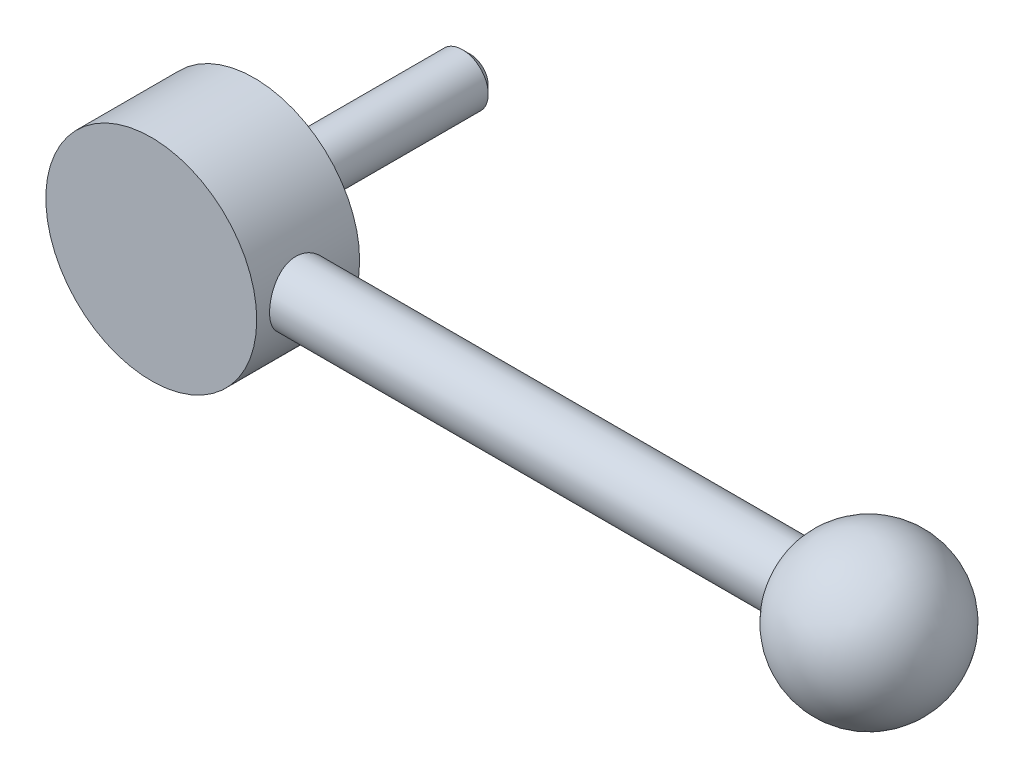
ISO-10303-21;
HEADER;
FILE_DESCRIPTION(('STEP AP214'),'2;1');
FILE_NAME('part.step','',(''),(''),'','','');
FILE_SCHEMA(('AUTOMOTIVE_DESIGN { 1 0 10303 214 1 1 1 1 }'));
ENDSEC;
DATA;
#1=APPLICATION_CONTEXT('core data for automotive mechanical design processes');
#2=APPLICATION_PROTOCOL_DEFINITION('international standard','automotive_design',2000,#1);
#3=PRODUCT_CONTEXT('',#1,'mechanical');
#4=PRODUCT('Part','Part','',(#3));
#5=PRODUCT_RELATED_PRODUCT_CATEGORY('part','',(#4));
#6=PRODUCT_DEFINITION_FORMATION('','',#4);
#7=PRODUCT_DEFINITION_CONTEXT('part definition',#1,'design');
#8=PRODUCT_DEFINITION('design','',#6,#7);
#9=PRODUCT_DEFINITION_SHAPE('','',#8);
#10=(LENGTH_UNIT() NAMED_UNIT(*) SI_UNIT(.MILLI.,.METRE.));
#11=(NAMED_UNIT(*) PLANE_ANGLE_UNIT() SI_UNIT($,.RADIAN.));
#12=(NAMED_UNIT(*) SI_UNIT($,.STERADIAN.) SOLID_ANGLE_UNIT());
#13=UNCERTAINTY_MEASURE_WITH_UNIT(LENGTH_MEASURE(1.E-05),#10,'distance_accuracy_value','');
#14=(GEOMETRIC_REPRESENTATION_CONTEXT(3) GLOBAL_UNCERTAINTY_ASSIGNED_CONTEXT((#13)) GLOBAL_UNIT_ASSIGNED_CONTEXT((#10,
#11,#12)) REPRESENTATION_CONTEXT('',''));
#15=CARTESIAN_POINT('',(0.,0.,0.));
#16=DIRECTION('',(0.,0.,1.));
#17=DIRECTION('',(1.,0.,0.));
#18=AXIS2_PLACEMENT_3D('',#15,#16,#17);
#19=CARTESIAN_POINT('',(0.,0.,40.));
#20=DIRECTION('',(0.,0.,1.));
#21=DIRECTION('',(1.,0.,0.));
#22=AXIS2_PLACEMENT_3D('',#19,#20,#21);
#23=CYLINDRICAL_SURFACE('',#22,9.5);
#24=CARTESIAN_POINT('',(0.,0.,2.));
#25=DIRECTION('',(0.,0.,1.));
#26=DIRECTION('',(1.,0.,0.));
#27=AXIS2_PLACEMENT_3D('',#24,#25,#26);
#28=CIRCLE('',#27,9.5);
#29=CARTESIAN_POINT('',(9.5,0.,2.));
#30=VERTEX_POINT('',#29);
#31=EDGE_CURVE('E37',#30,#30,#28,.T.);
#32=ORIENTED_EDGE('',*,*,#31,.F.);
#33=EDGE_LOOP('',(#32));
#34=FACE_BOUND('',#33,.T.);
#35=CARTESIAN_POINT('',(0.,0.,0.));
#36=DIRECTION('',(0.,0.,1.));
#37=DIRECTION('',(1.,0.,0.));
#38=AXIS2_PLACEMENT_3D('',#35,#36,#37);
#39=CIRCLE('',#38,9.5);
#40=CARTESIAN_POINT('',(9.5,0.,0.));
#41=VERTEX_POINT('',#40);
#42=EDGE_CURVE('E23',#41,#41,#39,.T.);
#43=ORIENTED_EDGE('',*,*,#42,.T.);
#44=EDGE_LOOP('',(#43));
#45=FACE_BOUND('',#44,.T.);
#46=ADVANCED_FACE('F12',(#34,#45),#23,.T.);
#47=CARTESIAN_POINT('',(5.,0.,0.));
#48=DIRECTION('',(0.,0.,1.));
#49=DIRECTION('',(1.,0.,0.));
#50=AXIS2_PLACEMENT_3D('',#47,#48,#49);
#51=PLANE('',#50);
#52=ORIENTED_EDGE('',*,*,#42,.F.);
#53=EDGE_LOOP('',(#52));
#54=FACE_BOUND('',#53,.T.);
#55=CARTESIAN_POINT('',(0.,0.,0.));
#56=DIRECTION('',(0.,0.,1.));
#57=DIRECTION('',(1.,0.,0.));
#58=AXIS2_PLACEMENT_3D('',#55,#56,#57);
#59=CIRCLE('',#58,5.);
#60=CARTESIAN_POINT('',(5.,0.,0.));
#61=VERTEX_POINT('',#60);
#62=EDGE_CURVE('E27',#61,#61,#59,.T.);
#63=ORIENTED_EDGE('',*,*,#62,.T.);
#64=EDGE_LOOP('',(#63));
#65=FACE_BOUND('',#64,.T.);
#66=ADVANCED_FACE('F63',(#54,#65),#51,.F.);
#67=CARTESIAN_POINT('',(0.,0.,40.));
#68=DIRECTION('',(0.,0.,1.));
#69=DIRECTION('',(1.,0.,0.));
#70=AXIS2_PLACEMENT_3D('',#67,#68,#69);
#71=CYLINDRICAL_SURFACE('',#70,5.);
#72=CARTESIAN_POINT('',(0.,0.,-38.5));
#73=DIRECTION('',(0.,0.,-1.));
#74=DIRECTION('',(-1.,0.,0.));
#75=AXIS2_PLACEMENT_3D('',#72,#73,#74);
#76=CIRCLE('',#75,5.);
#77=CARTESIAN_POINT('',(-5.,0.,-38.5));
#78=VERTEX_POINT('',#77);
#79=EDGE_CURVE('E19',#78,#78,#76,.F.);
#80=ORIENTED_EDGE('',*,*,#79,.T.);
#81=EDGE_LOOP('',(#80));
#82=FACE_BOUND('',#81,.T.);
#83=ORIENTED_EDGE('',*,*,#62,.F.);
#84=EDGE_LOOP('',(#83));
#85=FACE_BOUND('',#84,.T.);
#86=ADVANCED_FACE('F69',(#82,#85),#71,.T.);
#87=CARTESIAN_POINT('',(5.,0.,-40.));
#88=DIRECTION('',(0.,0.,-1.));
#89=DIRECTION('',(-1.,0.,0.));
#90=AXIS2_PLACEMENT_3D('',#87,#88,#89);
#91=PLANE('',#90);
#92=CARTESIAN_POINT('',(0.,0.,-40.));
#93=DIRECTION('',(0.,0.,-1.));
#94=DIRECTION('',(-1.,0.,0.));
#95=AXIS2_PLACEMENT_3D('',#92,#93,#94);
#96=CIRCLE('',#95,3.5);
#97=CARTESIAN_POINT('',(-3.5,0.,-40.));
#98=VERTEX_POINT('',#97);
#99=EDGE_CURVE('E8',#98,#98,#96,.T.);
#100=ORIENTED_EDGE('',*,*,#99,.T.);
#101=EDGE_LOOP('',(#100));
#102=FACE_BOUND('',#101,.T.);
#103=ADVANCED_FACE('F77',(#102),#91,.T.);
#104=CARTESIAN_POINT('',(20.5,0.,22.));
#105=DIRECTION('',(0.,0.,-1.));
#106=DIRECTION('',(-1.,0.,0.));
#107=AXIS2_PLACEMENT_3D('',#104,#105,#106);
#108=PLANE('',#107);
#109=CARTESIAN_POINT('',(0.,0.,22.));
#110=DIRECTION('',(0.,0.,1.));
#111=DIRECTION('',(1.,0.,0.));
#112=AXIS2_PLACEMENT_3D('',#109,#110,#111);
#113=CIRCLE('',#112,20.5);
#114=CARTESIAN_POINT('',(20.5,0.,22.));
#115=VERTEX_POINT('',#114);
#116=EDGE_CURVE('E86',#115,#115,#113,.T.);
#117=ORIENTED_EDGE('',*,*,#116,.T.);
#118=EDGE_LOOP('',(#117));
#119=FACE_BOUND('',#118,.T.);
#120=ADVANCED_FACE('F58',(#119),#108,.F.);
#121=CARTESIAN_POINT('',(0.,0.,40.));
#122=DIRECTION('',(0.,0.,1.));
#123=DIRECTION('',(1.,0.,0.));
#124=AXIS2_PLACEMENT_3D('',#121,#122,#123);
#125=CYLINDRICAL_SURFACE('',#124,20.5);
#126=CARTESIAN_POINT('',(20.5,0.,7.5));
#127=CARTESIAN_POINT('',(20.4999997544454,-0.164768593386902,7.50000038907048));
#128=CARTESIAN_POINT('',(20.4980087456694,-0.329544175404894,7.50679278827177));
#129=CARTESIAN_POINT('',(20.4900990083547,-0.65788822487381,7.5339021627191));
#130=CARTESIAN_POINT('',(20.4841800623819,-0.821456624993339,7.55421988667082));
#131=CARTESIAN_POINT('',(20.4685766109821,-1.1462122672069,7.60820100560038));
#132=CARTESIAN_POINT('',(20.4588916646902,-1.30739922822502,7.64186596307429));
#133=CARTESIAN_POINT('',(20.4360164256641,-1.62628314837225,7.72226244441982));
#134=CARTESIAN_POINT('',(20.4228249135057,-1.7839788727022,7.76899851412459));
#135=CARTESIAN_POINT('',(20.3933182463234,-2.09448185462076,7.87505403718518));
#136=CARTESIAN_POINT('',(20.3770082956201,-2.24729676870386,7.93435254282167));
#137=CARTESIAN_POINT('',(20.3416823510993,-2.54730770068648,8.06511256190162));
#138=CARTESIAN_POINT('',(20.3226662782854,-2.69450355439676,8.13657443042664));
#139=CARTESIAN_POINT('',(20.2824208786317,-2.98237032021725,8.2911456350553));
#140=CARTESIAN_POINT('',(20.2611910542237,-3.123039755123,8.37425759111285));
#141=CARTESIAN_POINT('',(20.2170775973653,-3.39691169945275,8.55150630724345));
#142=CARTESIAN_POINT('',(20.1941944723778,-3.53011647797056,8.6456396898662));
#143=CARTESIAN_POINT('',(20.146767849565,-3.79154794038,8.84682399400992));
#144=CARTESIAN_POINT('',(20.1221971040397,-3.91956600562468,8.95413966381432));
#145=CARTESIAN_POINT('',(20.0725990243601,-4.1661228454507,9.17897611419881));
#146=CARTESIAN_POINT('',(20.0475718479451,-4.2846648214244,9.29649342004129));
#147=CARTESIAN_POINT('',(19.9977175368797,-4.5116297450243,9.54108035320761));
#148=CARTESIAN_POINT('',(19.9728905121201,-4.62004743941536,9.66815487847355));
#149=CARTESIAN_POINT('',(19.9241410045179,-4.82595045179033,9.93095842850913));
#150=CARTESIAN_POINT('',(19.9002181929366,-4.92343976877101,10.0666842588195));
#151=CARTESIAN_POINT('',(19.8534354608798,-5.10885934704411,10.3490171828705));
#152=CARTESIAN_POINT('',(19.8306098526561,-5.19653638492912,10.4957964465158));
#153=CARTESIAN_POINT('',(19.7872868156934,-5.35913808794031,10.7965125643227));
#154=CARTESIAN_POINT('',(19.766788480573,-5.43406772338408,10.9504465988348));
#155=CARTESIAN_POINT('',(19.7287391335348,-5.57062666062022,11.2645036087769));
#156=CARTESIAN_POINT('',(19.7111887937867,-5.63225293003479,11.4246279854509));
#157=CARTESIAN_POINT('',(19.6796082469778,-5.74162541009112,11.7498143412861));
#158=CARTESIAN_POINT('',(19.6655765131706,-5.78937764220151,11.9148741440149));
#159=CARTESIAN_POINT('',(19.6418018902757,-5.86952471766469,12.2443484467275));
#160=CARTESIAN_POINT('',(19.6319555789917,-5.90229162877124,12.4086649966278));
#161=CARTESIAN_POINT('',(19.6163432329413,-5.95397424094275,12.7395899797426));
#162=CARTESIAN_POINT('',(19.6105755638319,-5.97289549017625,12.9061974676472));
#163=CARTESIAN_POINT('',(19.603301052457,-5.99672775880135,13.2405034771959));
#164=CARTESIAN_POINT('',(19.6017941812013,-6.00163887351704,13.4082019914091));
#165=CARTESIAN_POINT('',(19.6030905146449,-5.99740342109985,13.7434027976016));
#166=CARTESIAN_POINT('',(19.6058936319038,-5.98825713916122,13.9109050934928));
#167=CARTESIAN_POINT('',(19.6155486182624,-5.95655212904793,14.238688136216));
#168=CARTESIAN_POINT('',(19.6222578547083,-5.9344657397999,14.3990190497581));
#169=CARTESIAN_POINT('',(19.6394095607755,-5.87745500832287,14.7172343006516));
#170=CARTESIAN_POINT('',(19.649853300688,-5.84252629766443,14.8751177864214));
#171=CARTESIAN_POINT('',(19.6741615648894,-5.7601395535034,15.187257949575));
#172=CARTESIAN_POINT('',(19.688025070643,-5.71268525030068,15.3415156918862));
#173=CARTESIAN_POINT('',(19.7187796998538,-5.60560692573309,15.6454959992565));
#174=CARTESIAN_POINT('',(19.7356719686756,-5.5459782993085,15.7952168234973));
#175=CARTESIAN_POINT('',(19.7722410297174,-5.41416819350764,16.0910079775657));
#176=CARTESIAN_POINT('',(19.7919506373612,-5.34183608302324,16.2370072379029));
#177=CARTESIAN_POINT('',(19.8334359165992,-5.18568691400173,16.5224423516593));
#178=CARTESIAN_POINT('',(19.8552123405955,-5.10186566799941,16.6618757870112));
#179=CARTESIAN_POINT('',(19.9227548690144,-4.8340177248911,17.0689782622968));
#180=CARTESIAN_POINT('',(19.9707648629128,-4.63350124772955,17.3256854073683));
#181=CARTESIAN_POINT('',(20.0696162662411,-4.18511260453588,17.8126329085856));
#182=CARTESIAN_POINT('',(20.1204944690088,-3.93567819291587,18.0414205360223));
#183=CARTESIAN_POINT('',(20.2176813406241,-3.40132203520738,18.4542852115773));
#184=CARTESIAN_POINT('',(20.2639897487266,-3.11639826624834,18.63835970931));
#185=CARTESIAN_POINT('',(20.3472018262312,-2.51664006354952,18.9573414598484));
#186=CARTESIAN_POINT('',(20.3840462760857,-2.2016334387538,19.0919412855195));
#187=CARTESIAN_POINT('',(20.4437541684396,-1.55212614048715,19.3058343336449));
#188=CARTESIAN_POINT('',(20.4666213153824,-1.21763065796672,19.3851422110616));
#189=CARTESIAN_POINT('',(20.4952175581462,-0.550953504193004,19.4838192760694));
#190=CARTESIAN_POINT('',(20.5015074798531,-0.219085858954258,19.5051506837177));
#191=CARTESIAN_POINT('',(20.4978783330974,0.44350281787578,19.4927506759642));
#192=CARTESIAN_POINT('',(20.4879613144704,0.774223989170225,19.4590262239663));
#193=CARTESIAN_POINT('',(20.4533992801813,1.41781519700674,19.3390673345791));
#194=CARTESIAN_POINT('',(20.4290727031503,1.73091547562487,19.253967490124));
#195=CARTESIAN_POINT('',(20.3684901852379,2.33834273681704,19.0350155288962));
#196=CARTESIAN_POINT('',(20.3322328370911,2.63266749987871,18.901157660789));
#197=CARTESIAN_POINT('',(20.2505580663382,3.201467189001,18.585163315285));
#198=CARTESIAN_POINT('',(20.2049537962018,3.47535043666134,18.4020133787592));
#199=CARTESIAN_POINT('',(20.1098009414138,3.98926947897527,17.9937010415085));
#200=CARTESIAN_POINT('',(20.0602514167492,4.22929716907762,17.7685286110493));
#201=CARTESIAN_POINT('',(19.9860369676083,4.56311282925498,17.3996018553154));
#202=CARTESIAN_POINT('',(19.9608943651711,4.67160496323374,17.2689475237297));
#203=CARTESIAN_POINT('',(19.9116554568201,4.87720494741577,16.9988051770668));
#204=CARTESIAN_POINT('',(19.8875587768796,4.97431688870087,16.8593203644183));
#205=CARTESIAN_POINT('',(19.8411019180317,5.15650338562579,16.5723575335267));
#206=CARTESIAN_POINT('',(19.8187424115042,5.24157329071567,16.4248764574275));
#207=CARTESIAN_POINT('',(19.7764458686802,5.39896546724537,16.1230001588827));
#208=CARTESIAN_POINT('',(19.7565078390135,5.47129297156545,15.9686078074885));
#209=CARTESIAN_POINT('',(19.7197444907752,5.60234699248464,15.6546484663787));
#210=CARTESIAN_POINT('',(19.7029051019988,5.6611353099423,15.49510893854));
#211=CARTESIAN_POINT('',(19.6727610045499,5.76501533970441,15.1713718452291));
#212=CARTESIAN_POINT('',(19.6594548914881,5.81011249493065,15.0071761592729));
#213=CARTESIAN_POINT('',(19.6367999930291,5.88622676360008,14.675294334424));
#214=CARTESIAN_POINT('',(19.6274509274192,5.91724487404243,14.5076084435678));
#215=CARTESIAN_POINT('',(19.6130187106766,5.96490739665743,14.1700260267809));
#216=CARTESIAN_POINT('',(19.6079354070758,5.98155232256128,14.0001295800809));
#217=CARTESIAN_POINT('',(19.6023186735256,5.9999323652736,13.6662567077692));
#218=CARTESIAN_POINT('',(19.6016119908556,6.00223524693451,13.5023141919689));
#219=CARTESIAN_POINT('',(19.6043094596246,5.99341910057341,13.1747666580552));
#220=CARTESIAN_POINT('',(19.6077150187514,5.98229547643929,13.0111617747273));
#221=CARTESIAN_POINT('',(19.6185313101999,5.94672790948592,12.6856110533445));
#222=CARTESIAN_POINT('',(19.6259403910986,5.92228945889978,12.5236645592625));
#223=CARTESIAN_POINT('',(19.6445384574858,5.86030325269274,12.2024601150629));
#224=CARTESIAN_POINT('',(19.6557288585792,5.82275058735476,12.0432031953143));
#225=CARTESIAN_POINT('',(19.6814005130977,5.73537439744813,11.7303823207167));
#226=CARTESIAN_POINT('',(19.6958418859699,5.68569901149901,11.5767736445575));
#227=CARTESIAN_POINT('',(19.7276768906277,5.57423736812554,11.2742707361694));
#228=CARTESIAN_POINT('',(19.7450715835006,5.51244675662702,11.125378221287));
#229=CARTESIAN_POINT('',(19.782319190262,5.37724463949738,10.8333301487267));
#230=CARTESIAN_POINT('',(19.802171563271,5.30383568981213,10.6901733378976));
#231=CARTESIAN_POINT('',(19.8438063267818,5.14587421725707,10.4103722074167));
#232=CARTESIAN_POINT('',(19.8655894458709,5.061317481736,10.2737303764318));
#233=CARTESIAN_POINT('',(19.9112797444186,4.87853600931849,10.0032239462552));
#234=CARTESIAN_POINT('',(19.9352342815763,4.77994030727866,9.86961789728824));
#235=CARTESIAN_POINT('',(19.9839347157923,4.57206196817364,9.61107007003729));
#236=CARTESIAN_POINT('',(20.0086809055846,4.46277534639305,9.48613155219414));
#237=CARTESIAN_POINT('',(20.0582834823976,4.23425660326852,9.24575891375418));
#238=CARTESIAN_POINT('',(20.0831398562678,4.11502564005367,9.13032368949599));
#239=CARTESIAN_POINT('',(20.1323098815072,3.86730499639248,8.90963180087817));
#240=CARTESIAN_POINT('',(20.1566233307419,3.7388119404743,8.80437888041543));
#241=CARTESIAN_POINT('',(20.2046974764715,3.46977987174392,8.6020699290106));
#242=CARTESIAN_POINT('',(20.2284250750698,3.32900807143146,8.50531528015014));
#243=CARTESIAN_POINT('',(20.2739466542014,3.03949915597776,8.32403500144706));
#244=CARTESIAN_POINT('',(20.2957406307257,2.8907620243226,8.23950939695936));
#245=CARTESIAN_POINT('',(20.3367679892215,2.58639447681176,8.0833769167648));
#246=CARTESIAN_POINT('',(20.356002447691,2.43076699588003,8.01176460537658));
#247=CARTESIAN_POINT('',(20.3913677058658,2.11366097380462,7.88201306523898));
#248=CARTESIAN_POINT('',(20.4074988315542,1.95218304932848,7.82387242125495));
#249=CARTESIAN_POINT('',(20.4344672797,1.64423058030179,7.72771145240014));
#250=CARTESIAN_POINT('',(20.4457076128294,1.49828162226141,7.68811373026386));
#251=CARTESIAN_POINT('',(20.4651675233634,1.2036242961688,7.62002138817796));
#252=CARTESIAN_POINT('',(20.4733873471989,1.0549161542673,7.59152586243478));
#253=CARTESIAN_POINT('',(20.4866168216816,0.755624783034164,7.54584620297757));
#254=CARTESIAN_POINT('',(20.491626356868,0.605041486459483,7.52866247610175));
#255=CARTESIAN_POINT('',(20.49831762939,0.302973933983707,7.50574067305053));
#256=CARTESIAN_POINT('',(20.5000002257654,0.151489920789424,7.49999964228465));
#257=CARTESIAN_POINT('',(20.5,0.,7.5));
#258=B_SPLINE_CURVE_WITH_KNOTS('',3,(#126,#127,#128,#129,#130,#131,#132,#133,#134,#135,#136,
#137,#138,#139,#140,#141,#142,#143,#144,#145,#146,#147,#148,#149,#150,#151,#152,#153,#154,#155,
#156,#157,#158,#159,#160,#161,#162,#163,#164,#165,#166,#167,#168,#169,#170,#171,#172,#173,#174,
#175,#176,#177,#178,#179,#180,#181,#182,#183,#184,#185,#186,#187,#188,#189,#190,#191,#192,#193,
#194,#195,#196,#197,#198,#199,#200,#201,#202,#203,#204,#205,#206,#207,#208,#209,#210,#211,#212,
#213,#214,#215,#216,#217,#218,#219,#220,#221,#222,#223,#224,#225,#226,#227,#228,#229,#230,#231,
#232,#233,#234,#235,#236,#237,#238,#239,#240,#241,#242,#243,#244,#245,#246,#247,#248,#249,#250,
#251,#252,#253,#254,#255,#256,#257),.UNSPECIFIED.,.T.,.F.,(4,2,2,2,2,2,2,2,2,2,2,2,2,2,2,2,2,2,
2,2,2,2,2,2,2,2,2,2,2,2,2,2,2,2,2,2,2,2,2,2,2,2,2,2,2,2,2,2,2,2,2,2,2,2,2,2,2,2,2,2,2,2,2,2,2,
4),(0.,0.494166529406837,0.988360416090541,1.48261217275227,1.97703603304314,2.47064184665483,
2.96426207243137,3.45799348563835,3.95157399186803,4.45753270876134,4.96331976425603,
5.46936781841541,5.97523008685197,6.49206535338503,7.00869863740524,7.52544955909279,
8.04197586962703,8.54486934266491,9.04756118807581,9.55024961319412,10.0529278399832,
10.5383093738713,11.0238561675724,11.5092585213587,11.9948448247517,12.4866344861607,
12.9786038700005,13.9617709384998,14.9839152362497,16.006117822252,17.0345689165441,
18.062747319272,19.0556662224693,20.0484595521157,21.0200911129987,21.9918373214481,
22.9853318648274,23.97906383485,24.4935931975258,25.0079370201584,25.5224789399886,
26.0368090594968,26.5487427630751,27.0604726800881,27.5721663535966,28.0838417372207,
28.5751252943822,29.066577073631,29.5578262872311,30.0492596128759,30.5349645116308,
31.0208442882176,31.5066173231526,31.9925744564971,32.4953010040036,32.9982156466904,
33.5010718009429,34.0041121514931,34.5208552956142,35.0375995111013,35.5541256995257,
36.0705976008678,36.525077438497,36.9795201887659,37.4339792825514,37.8883210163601),.UNSPECIFIED.);
#259=CARTESIAN_POINT('',(20.5,0.,7.5));
#260=VERTEX_POINT('',#259);
#261=EDGE_CURVE('E30',#260,#260,#258,.T.);
#262=ORIENTED_EDGE('',*,*,#261,.T.);
#263=EDGE_LOOP('',(#262));
#264=FACE_BOUND('',#263,.T.);
#265=ORIENTED_EDGE('',*,*,#116,.F.);
#266=EDGE_LOOP('',(#265));
#267=FACE_BOUND('',#266,.T.);
#268=CARTESIAN_POINT('',(0.,0.,2.));
#269=DIRECTION('',(0.,0.,1.));
#270=DIRECTION('',(1.,0.,0.));
#271=AXIS2_PLACEMENT_3D('',#268,#269,#270);
#272=CIRCLE('',#271,20.5);
#273=CARTESIAN_POINT('',(20.5,0.,2.));
#274=VERTEX_POINT('',#273);
#275=EDGE_CURVE('E88',#274,#274,#272,.T.);
#276=ORIENTED_EDGE('',*,*,#275,.T.);
#277=EDGE_LOOP('',(#276));
#278=FACE_BOUND('',#277,.T.);
#279=ADVANCED_FACE('F40',(#264,#267,#278),#125,.T.);
#280=CARTESIAN_POINT('',(9.5,0.,2.));
#281=DIRECTION('',(0.,0.,1.));
#282=DIRECTION('',(1.,0.,0.));
#283=AXIS2_PLACEMENT_3D('',#280,#281,#282);
#284=PLANE('',#283);
#285=ORIENTED_EDGE('',*,*,#275,.F.);
#286=EDGE_LOOP('',(#285));
#287=FACE_BOUND('',#286,.T.);
#288=ORIENTED_EDGE('',*,*,#31,.T.);
#289=EDGE_LOOP('',(#288));
#290=FACE_BOUND('',#289,.T.);
#291=ADVANCED_FACE('F49',(#287,#290),#284,.F.);
#292=CARTESIAN_POINT('',(-30.,0.,13.5));
#293=DIRECTION('',(-1.,0.,0.));
#294=DIRECTION('',(0.,0.,1.));
#295=AXIS2_PLACEMENT_3D('',#292,#293,#294);
#296=CYLINDRICAL_SURFACE('',#295,6.);
#297=CARTESIAN_POINT('',(117.252272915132,0.,13.5));
#298=DIRECTION('',(-1.,0.,0.));
#299=DIRECTION('',(0.,0.,1.));
#300=AXIS2_PLACEMENT_3D('',#297,#298,#299);
#301=CIRCLE('',#300,6.);
#302=CARTESIAN_POINT('',(117.252272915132,0.,19.5));
#303=VERTEX_POINT('',#302);
#304=EDGE_CURVE('E38',#303,#303,#301,.T.);
#305=ORIENTED_EDGE('',*,*,#304,.T.);
#306=EDGE_LOOP('',(#305));
#307=FACE_BOUND('',#306,.T.);
#308=ORIENTED_EDGE('',*,*,#261,.F.);
#309=EDGE_LOOP('',(#308));
#310=FACE_BOUND('',#309,.T.);
#311=ADVANCED_FACE('F44',(#307,#310),#296,.T.);
#312=CARTESIAN_POINT('',(131.,0.,13.5));
#313=DIRECTION('',(0.,0.,1.));
#314=DIRECTION('',(1.,0.,0.));
#315=AXIS2_PLACEMENT_3D('',#312,#313,#314);
#316=SPHERICAL_SURFACE('',#315,15.);
#317=CARTESIAN_POINT('',(131.,0.,13.5));
#318=DIRECTION('',(-1.,0.,0.));
#319=DIRECTION('',(0.,0.,1.));
#320=AXIS2_PLACEMENT_3D('',#317,#318,#319);
#321=SPHERICAL_SURFACE('',#320,15.);
#322=ORIENTED_EDGE('',*,*,#304,.F.);
#323=EDGE_LOOP('',(#322));
#324=FACE_BOUND('',#323,.T.);
#325=ADVANCED_FACE('F48',(#324),#321,.T.);
#326=CARTESIAN_POINT('',(0.,0.,-38.5));
#327=DIRECTION('',(0.,0.,1.));
#328=DIRECTION('',(1.,0.,0.));
#329=AXIS2_PLACEMENT_3D('',#326,#327,#328);
#330=CONICAL_SURFACE('',#329,5.,0.785398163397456);
#331=ORIENTED_EDGE('',*,*,#99,.F.);
#332=EDGE_LOOP('',(#331));
#333=FACE_BOUND('',#332,.T.);
#334=ORIENTED_EDGE('',*,*,#79,.F.);
#335=EDGE_LOOP('',(#334));
#336=FACE_BOUND('',#335,.T.);
#337=ADVANCED_FACE('F14',(#333,#336),#330,.T.);
#338=CLOSED_SHELL('',(#46,#66,#86,#103,#120,#279,#291,#311,#325,#337));
#339=MANIFOLD_SOLID_BREP('B1',#338);
#340=ADVANCED_BREP_SHAPE_REPRESENTATION('',(#18,#339),#14);
#341=SHAPE_DEFINITION_REPRESENTATION(#9,#340);
ENDSEC;
END-ISO-10303-21;
